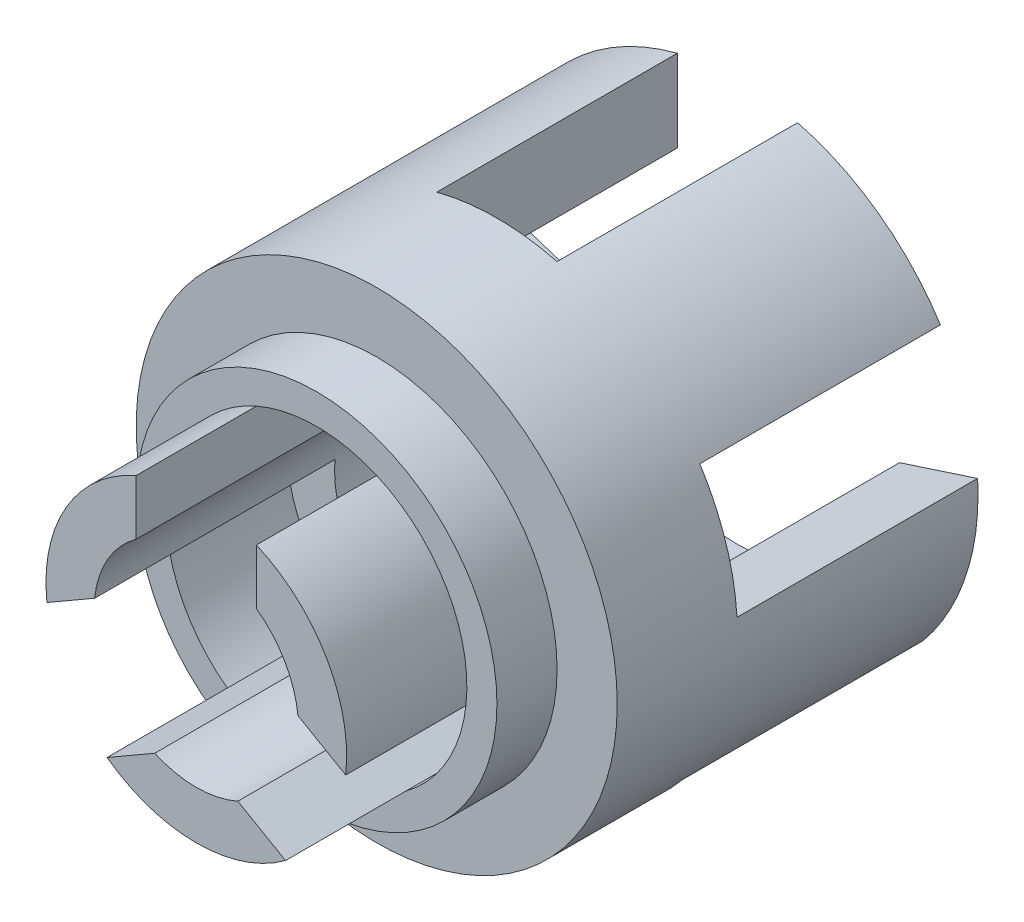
ISO-10303-21;
HEADER;
FILE_DESCRIPTION(('STEP AP214'),'2;1');
FILE_NAME('part.step','',(''),(''),'','','');
FILE_SCHEMA(('AUTOMOTIVE_DESIGN { 1 0 10303 214 1 1 1 1 }'));
ENDSEC;
DATA;
#1=APPLICATION_CONTEXT('core data for automotive mechanical design processes');
#2=APPLICATION_PROTOCOL_DEFINITION('international standard','automotive_design',2000,#1);
#3=PRODUCT_CONTEXT('',#1,'mechanical');
#4=PRODUCT('Part','Part','',(#3));
#5=PRODUCT_RELATED_PRODUCT_CATEGORY('part','',(#4));
#6=PRODUCT_DEFINITION_FORMATION('','',#4);
#7=PRODUCT_DEFINITION_CONTEXT('part definition',#1,'design');
#8=PRODUCT_DEFINITION('design','',#6,#7);
#9=PRODUCT_DEFINITION_SHAPE('','',#8);
#10=(LENGTH_UNIT() NAMED_UNIT(*) SI_UNIT(.MILLI.,.METRE.));
#11=(NAMED_UNIT(*) PLANE_ANGLE_UNIT() SI_UNIT($,.RADIAN.));
#12=(NAMED_UNIT(*) SI_UNIT($,.STERADIAN.) SOLID_ANGLE_UNIT());
#13=UNCERTAINTY_MEASURE_WITH_UNIT(LENGTH_MEASURE(1.E-05),#10,'distance_accuracy_value','');
#14=(GEOMETRIC_REPRESENTATION_CONTEXT(3) GLOBAL_UNCERTAINTY_ASSIGNED_CONTEXT((#13)) GLOBAL_UNIT_ASSIGNED_CONTEXT((#10,
#11,#12)) REPRESENTATION_CONTEXT('',''));
#15=CARTESIAN_POINT('',(0.,0.,0.));
#16=DIRECTION('',(0.,0.,1.));
#17=DIRECTION('',(1.,0.,0.));
#18=AXIS2_PLACEMENT_3D('',#15,#16,#17);
#19=CARTESIAN_POINT('',(0.,0.,1.27));
#20=DIRECTION('',(0.,0.,1.));
#21=DIRECTION('',(1.,0.,0.));
#22=AXIS2_PLACEMENT_3D('',#19,#20,#21);
#23=PLANE('',#22);
#24=CARTESIAN_POINT('',(0.,0.,1.27));
#25=DIRECTION('',(0.,0.,1.));
#26=DIRECTION('',(1.,0.,0.));
#27=AXIS2_PLACEMENT_3D('',#24,#25,#26);
#28=CIRCLE('',#27,3.81);
#29=CARTESIAN_POINT('',(3.81,0.,1.27));
#30=VERTEX_POINT('',#29);
#31=EDGE_CURVE('E498',#30,#30,#28,.T.);
#32=ORIENTED_EDGE('',*,*,#31,.T.);
#33=EDGE_LOOP('',(#32));
#34=FACE_BOUND('',#33,.T.);
#35=CARTESIAN_POINT('',(0.,0.,1.27));
#36=DIRECTION('',(0.,0.,1.));
#37=DIRECTION('',(1.,0.,0.));
#38=AXIS2_PLACEMENT_3D('',#35,#36,#37);
#39=CIRCLE('',#38,3.175);
#40=CARTESIAN_POINT('',(1.88507812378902,-2.55482004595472,1.27));
#41=VERTEX_POINT('',#40);
#42=CARTESIAN_POINT('',(3.15507812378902,-0.355115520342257,1.27));
#43=VERTEX_POINT('',#42);
#44=EDGE_CURVE('E501',#41,#43,#39,.T.);
#45=ORIENTED_EDGE('',*,*,#44,.F.);
#46=CARTESIAN_POINT('',(0.,0.,1.27));
#47=DIRECTION('',(0.,0.,1.));
#48=DIRECTION('',(1.,0.,0.));
#49=AXIS2_PLACEMENT_3D('',#46,#47,#48);
#50=CIRCLE('',#49,3.175);
#51=CARTESIAN_POINT('',(-1.88507812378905,-2.5548200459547,1.27));
#52=VERTEX_POINT('',#51);
#53=EDGE_CURVE('E303',#52,#41,#50,.T.);
#54=ORIENTED_EDGE('',*,*,#53,.F.);
#55=CARTESIAN_POINT('',(0.,0.,1.27));
#56=DIRECTION('',(0.,0.,1.));
#57=DIRECTION('',(1.,0.,0.));
#58=AXIS2_PLACEMENT_3D('',#55,#56,#57);
#59=CIRCLE('',#58,3.175);
#60=CARTESIAN_POINT('',(-3.15507812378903,-0.355115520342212,1.27));
#61=VERTEX_POINT('',#60);
#62=EDGE_CURVE('E504',#61,#52,#59,.T.);
#63=ORIENTED_EDGE('',*,*,#62,.F.);
#64=CARTESIAN_POINT('',(0.,0.,1.27));
#65=DIRECTION('',(0.,0.,1.));
#66=DIRECTION('',(1.,0.,0.));
#67=AXIS2_PLACEMENT_3D('',#64,#65,#66);
#68=CIRCLE('',#67,3.175);
#69=CARTESIAN_POINT('',(-1.27,2.90993556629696,1.27));
#70=VERTEX_POINT('',#69);
#71=EDGE_CURVE('E355',#70,#61,#68,.T.);
#72=ORIENTED_EDGE('',*,*,#71,.F.);
#73=CARTESIAN_POINT('',(0.,0.,1.27));
#74=DIRECTION('',(0.,0.,1.));
#75=DIRECTION('',(1.,0.,0.));
#76=AXIS2_PLACEMENT_3D('',#73,#74,#75);
#77=CIRCLE('',#76,3.175);
#78=CARTESIAN_POINT('',(1.27,2.90993556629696,1.27));
#79=VERTEX_POINT('',#78);
#80=EDGE_CURVE('E507',#79,#70,#77,.T.);
#81=ORIENTED_EDGE('',*,*,#80,.F.);
#82=CARTESIAN_POINT('',(0.,0.,1.27));
#83=DIRECTION('',(0.,0.,1.));
#84=DIRECTION('',(1.,0.,0.));
#85=AXIS2_PLACEMENT_3D('',#82,#83,#84);
#86=CIRCLE('',#85,3.175);
#87=EDGE_CURVE('E340',#43,#79,#86,.T.);
#88=ORIENTED_EDGE('',*,*,#87,.F.);
#89=EDGE_LOOP('',(#45,#54,#63,#72,#81,#88));
#90=FACE_BOUND('',#89,.T.);
#91=ADVANCED_FACE('F36',(#34,#90),#23,.T.);
#92=CARTESIAN_POINT('',(0.,0.,-7.62));
#93=DIRECTION('',(0.,0.,1.));
#94=DIRECTION('',(1.,0.,0.));
#95=AXIS2_PLACEMENT_3D('',#92,#93,#94);
#96=CYLINDRICAL_SURFACE('',#95,5.08);
#97=DIRECTION('',(0.,0.,-1.));
#98=VECTOR('',#97,1.);
#99=CARTESIAN_POINT('',(1.27,4.91868884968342,-2.54));
#100=LINE('',#99,#98);
#101=CARTESIAN_POINT('',(1.27,4.91868884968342,-2.54));
#102=VERTEX_POINT('',#101);
#103=CARTESIAN_POINT('',(1.27,4.91868884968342,-7.62));
#104=VERTEX_POINT('',#103);
#105=EDGE_CURVE('E392',#102,#104,#100,.T.);
#106=ORIENTED_EDGE('',*,*,#105,.F.);
#107=CARTESIAN_POINT('',(0.,0.,-2.54));
#108=DIRECTION('',(0.,0.,-1.));
#109=DIRECTION('',(-1.,0.,0.));
#110=AXIS2_PLACEMENT_3D('',#107,#108,#109);
#111=CIRCLE('',#110,5.08);
#112=CARTESIAN_POINT('',(-1.27,4.91868884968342,-2.54));
#113=VERTEX_POINT('',#112);
#114=EDGE_CURVE('E377',#113,#102,#111,.T.);
#115=ORIENTED_EDGE('',*,*,#114,.F.);
#116=DIRECTION('',(0.,0.,-1.));
#117=VECTOR('',#116,1.);
#118=CARTESIAN_POINT('',(-1.27,4.91868884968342,-2.54));
#119=LINE('',#118,#117);
#120=CARTESIAN_POINT('',(-1.27,4.91868884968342,-7.62));
#121=VERTEX_POINT('',#120);
#122=EDGE_CURVE('E394',#113,#121,#119,.T.);
#123=ORIENTED_EDGE('',*,*,#122,.T.);
#124=CARTESIAN_POINT('',(0.,0.,-7.62));
#125=DIRECTION('',(0.,0.,1.));
#126=DIRECTION('',(1.,0.,0.));
#127=AXIS2_PLACEMENT_3D('',#124,#125,#126);
#128=CIRCLE('',#127,5.08);
#129=CARTESIAN_POINT('',(-4.2854994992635,2.72780022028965,-7.62));
#130=VERTEX_POINT('',#129);
#131=EDGE_CURVE('E45',#121,#130,#128,.T.);
#132=ORIENTED_EDGE('',*,*,#131,.T.);
#133=DIRECTION('',(0.,0.,-1.));
#134=VECTOR('',#133,1.);
#135=CARTESIAN_POINT('',(-4.2854994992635,2.72780022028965,-2.54));
#136=LINE('',#135,#134);
#137=CARTESIAN_POINT('',(-4.2854994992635,2.72780022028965,-2.54));
#138=VERTEX_POINT('',#137);
#139=EDGE_CURVE('E476',#138,#130,#136,.T.);
#140=ORIENTED_EDGE('',*,*,#139,.F.);
#141=CARTESIAN_POINT('',(0.,0.,-2.54));
#142=DIRECTION('',(0.,0.,-1.));
#143=DIRECTION('',(-1.,0.,0.));
#144=AXIS2_PLACEMENT_3D('',#141,#142,#143);
#145=CIRCLE('',#144,5.08);
#146=CARTESIAN_POINT('',(-5.07040266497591,0.312116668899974,-2.54));
#147=VERTEX_POINT('',#146);
#148=EDGE_CURVE('E462',#147,#138,#145,.T.);
#149=ORIENTED_EDGE('',*,*,#148,.F.);
#150=DIRECTION('',(0.,0.,-1.));
#151=VECTOR('',#150,1.);
#152=CARTESIAN_POINT('',(-5.07040266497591,0.312116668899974,-2.54));
#153=LINE('',#152,#151);
#154=CARTESIAN_POINT('',(-5.07040266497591,0.312116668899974,-7.62));
#155=VERTEX_POINT('',#154);
#156=EDGE_CURVE('E468',#147,#155,#153,.T.);
#157=ORIENTED_EDGE('',*,*,#156,.T.);
#158=CARTESIAN_POINT('',(-3.91858434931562,-3.23281559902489,-7.62));
#159=VERTEX_POINT('',#158);
#160=EDGE_CURVE('E577',#155,#159,#128,.T.);
#161=ORIENTED_EDGE('',*,*,#160,.T.);
#162=DIRECTION('',(0.,0.,-1.));
#163=VECTOR('',#162,1.);
#164=CARTESIAN_POINT('',(-3.91858434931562,-3.23281559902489,-2.54));
#165=LINE('',#164,#163);
#166=CARTESIAN_POINT('',(-3.91858434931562,-3.23281559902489,-2.54));
#167=VERTEX_POINT('',#166);
#168=EDGE_CURVE('E456',#167,#159,#165,.T.);
#169=ORIENTED_EDGE('',*,*,#168,.F.);
#170=CARTESIAN_POINT('',(0.,0.,-2.54));
#171=DIRECTION('',(0.,0.,-1.));
#172=DIRECTION('',(-1.,0.,0.));
#173=AXIS2_PLACEMENT_3D('',#170,#171,#172);
#174=CIRCLE('',#173,5.08);
#175=CARTESIAN_POINT('',(-1.86368118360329,-4.72579013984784,-2.54));
#176=VERTEX_POINT('',#175);
#177=EDGE_CURVE('E442',#176,#167,#174,.T.);
#178=ORIENTED_EDGE('',*,*,#177,.F.);
#179=DIRECTION('',(0.,0.,-1.));
#180=VECTOR('',#179,1.);
#181=CARTESIAN_POINT('',(-1.86368118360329,-4.72579013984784,-2.54));
#182=LINE('',#181,#180);
#183=CARTESIAN_POINT('',(-1.86368118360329,-4.72579013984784,-7.62));
#184=VERTEX_POINT('',#183);
#185=EDGE_CURVE('E446',#176,#184,#182,.T.);
#186=ORIENTED_EDGE('',*,*,#185,.T.);
#187=CARTESIAN_POINT('',(1.86368118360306,-4.72579013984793,-7.62));
#188=VERTEX_POINT('',#187);
#189=EDGE_CURVE('E524',#184,#188,#128,.T.);
#190=ORIENTED_EDGE('',*,*,#189,.T.);
#191=DIRECTION('',(0.,0.,-1.));
#192=VECTOR('',#191,1.);
#193=CARTESIAN_POINT('',(1.86368118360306,-4.72579013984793,-2.54));
#194=LINE('',#193,#192);
#195=CARTESIAN_POINT('',(1.86368118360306,-4.72579013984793,-2.54));
#196=VERTEX_POINT('',#195);
#197=EDGE_CURVE('E436',#196,#188,#194,.T.);
#198=ORIENTED_EDGE('',*,*,#197,.F.);
#199=CARTESIAN_POINT('',(0.,0.,-2.54));
#200=DIRECTION('',(0.,0.,-1.));
#201=DIRECTION('',(-1.,0.,0.));
#202=AXIS2_PLACEMENT_3D('',#199,#200,#201);
#203=CIRCLE('',#202,5.08);
#204=CARTESIAN_POINT('',(3.91858434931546,-3.23281559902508,-2.54));
#205=VERTEX_POINT('',#204);
#206=EDGE_CURVE('E422',#205,#196,#203,.T.);
#207=ORIENTED_EDGE('',*,*,#206,.F.);
#208=DIRECTION('',(0.,0.,-1.));
#209=VECTOR('',#208,1.);
#210=CARTESIAN_POINT('',(3.91858434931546,-3.23281559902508,-2.54));
#211=LINE('',#210,#209);
#212=CARTESIAN_POINT('',(3.91858434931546,-3.23281559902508,-7.62));
#213=VERTEX_POINT('',#212);
#214=EDGE_CURVE('E426',#205,#213,#211,.T.);
#215=ORIENTED_EDGE('',*,*,#214,.T.);
#216=CARTESIAN_POINT('',(5.07040266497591,0.31211666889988,-7.62));
#217=VERTEX_POINT('',#216);
#218=EDGE_CURVE('E47',#213,#217,#128,.T.);
#219=ORIENTED_EDGE('',*,*,#218,.T.);
#220=DIRECTION('',(0.,0.,-1.));
#221=VECTOR('',#220,1.);
#222=CARTESIAN_POINT('',(5.07040266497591,0.31211666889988,-2.54));
#223=LINE('',#222,#221);
#224=CARTESIAN_POINT('',(5.07040266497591,0.31211666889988,-2.54));
#225=VERTEX_POINT('',#224);
#226=EDGE_CURVE('E416',#225,#217,#223,.T.);
#227=ORIENTED_EDGE('',*,*,#226,.F.);
#228=CARTESIAN_POINT('',(0.,0.,-2.54));
#229=DIRECTION('',(0.,0.,-1.));
#230=DIRECTION('',(-1.,0.,0.));
#231=AXIS2_PLACEMENT_3D('',#228,#229,#230);
#232=CIRCLE('',#231,5.08);
#233=CARTESIAN_POINT('',(4.28549949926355,2.72780022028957,-2.54));
#234=VERTEX_POINT('',#233);
#235=EDGE_CURVE('E400',#234,#225,#232,.T.);
#236=ORIENTED_EDGE('',*,*,#235,.F.);
#237=DIRECTION('',(0.,0.,-1.));
#238=VECTOR('',#237,1.);
#239=CARTESIAN_POINT('',(4.28549949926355,2.72780022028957,-2.54));
#240=LINE('',#239,#238);
#241=CARTESIAN_POINT('',(4.28549949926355,2.72780022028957,-7.62));
#242=VERTEX_POINT('',#241);
#243=EDGE_CURVE('E406',#234,#242,#240,.T.);
#244=ORIENTED_EDGE('',*,*,#243,.T.);
#245=EDGE_CURVE('E12',#242,#104,#128,.T.);
#246=ORIENTED_EDGE('',*,*,#245,.T.);
#247=EDGE_LOOP('',(#106,#115,#123,#132,#140,#149,#157,#161,#169,#178,#186,#190,#198,#207,#215,
#219,#227,#236,#244,#246));
#248=FACE_BOUND('',#247,.T.);
#249=CARTESIAN_POINT('',(0.,0.,0.));
#250=DIRECTION('',(0.,0.,1.));
#251=DIRECTION('',(1.,0.,0.));
#252=AXIS2_PLACEMENT_3D('',#249,#250,#251);
#253=CIRCLE('',#252,5.08);
#254=CARTESIAN_POINT('',(5.08,0.,0.));
#255=VERTEX_POINT('',#254);
#256=EDGE_CURVE('E522',#255,#255,#253,.T.);
#257=ORIENTED_EDGE('',*,*,#256,.F.);
#258=EDGE_LOOP('',(#257));
#259=FACE_BOUND('',#258,.T.);
#260=ADVANCED_FACE('F38',(#248,#259),#96,.T.);
#261=CARTESIAN_POINT('',(0.,0.,-7.62));
#262=DIRECTION('',(0.,0.,1.));
#263=DIRECTION('',(1.,0.,0.));
#264=AXIS2_PLACEMENT_3D('',#261,#262,#263);
#265=PLANE('',#264);
#266=DIRECTION('',(0.,-1.,0.));
#267=VECTOR('',#266,1.);
#268=CARTESIAN_POINT('',(-1.27,0.,-7.62));
#269=LINE('',#268,#267);
#270=CARTESIAN_POINT('',(-1.27,3.18514379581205,-7.62));
#271=VERTEX_POINT('',#270);
#272=EDGE_CURVE('E383',#121,#271,#269,.T.);
#273=ORIENTED_EDGE('',*,*,#272,.T.);
#274=CARTESIAN_POINT('',(0.,0.,-7.62));
#275=DIRECTION('',(0.,0.,-1.));
#276=DIRECTION('',(-1.,0.,0.));
#277=AXIS2_PLACEMENT_3D('',#274,#275,#276);
#278=CIRCLE('',#277,3.429);
#279=CARTESIAN_POINT('',(-2.63680017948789,2.19210533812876,-7.62));
#280=VERTEX_POINT('',#279);
#281=EDGE_CURVE('E485',#280,#271,#278,.T.);
#282=ORIENTED_EDGE('',*,*,#281,.F.);
#283=DIRECTION('',(0.951056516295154,-0.309016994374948,0.));
#284=VECTOR('',#283,1.);
#285=CARTESIAN_POINT('',(0.392451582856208,1.20784177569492,-7.62));
#286=LINE('',#285,#284);
#287=EDGE_CURVE('E463',#130,#280,#286,.T.);
#288=ORIENTED_EDGE('',*,*,#287,.F.);
#289=ORIENTED_EDGE('',*,*,#131,.F.);
#290=EDGE_LOOP('',(#273,#282,#288,#289));
#291=FACE_BOUND('',#290,.T.);
#292=ADVANCED_FACE('F532',(#291),#265,.F.);
#293=CARTESIAN_POINT('',(1.27,3.18514379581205,-7.62));
#294=VERTEX_POINT('',#293);
#295=CARTESIAN_POINT('',(2.63680017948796,2.19210533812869,-7.62));
#296=VERTEX_POINT('',#295);
#297=EDGE_CURVE('E488',#294,#296,#278,.T.);
#298=ORIENTED_EDGE('',*,*,#297,.F.);
#299=DIRECTION('',(0.,-1.,0.));
#300=VECTOR('',#299,1.);
#301=CARTESIAN_POINT('',(1.27,0.,-7.62));
#302=LINE('',#301,#300);
#303=EDGE_CURVE('E378',#104,#294,#302,.T.);
#304=ORIENTED_EDGE('',*,*,#303,.F.);
#305=ORIENTED_EDGE('',*,*,#245,.F.);
#306=DIRECTION('',(-0.951056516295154,-0.309016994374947,0.));
#307=VECTOR('',#306,1.);
#308=CARTESIAN_POINT('',(-0.39245158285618,1.20784177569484,-7.62));
#309=LINE('',#308,#307);
#310=EDGE_CURVE('E407',#242,#296,#309,.T.);
#311=ORIENTED_EDGE('',*,*,#310,.T.);
#312=EDGE_LOOP('',(#298,#304,#305,#311));
#313=FACE_BOUND('',#312,.T.);
#314=ADVANCED_FACE('F538',(#313),#265,.F.);
#315=CARTESIAN_POINT('',(3.42170334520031,-0.223578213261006,-7.62));
#316=VERTEX_POINT('',#315);
#317=CARTESIAN_POINT('',(2.89963213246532,-1.83034818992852,-7.62));
#318=VERTEX_POINT('',#317);
#319=EDGE_CURVE('E557',#316,#318,#278,.T.);
#320=ORIENTED_EDGE('',*,*,#319,.F.);
#321=DIRECTION('',(-0.951056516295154,-0.309016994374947,0.));
#322=VECTOR('',#321,1.);
#323=CARTESIAN_POINT('',(0.392451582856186,-1.20784177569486,-7.62));
#324=LINE('',#323,#322);
#325=EDGE_CURVE('E401',#217,#316,#324,.T.);
#326=ORIENTED_EDGE('',*,*,#325,.F.);
#327=ORIENTED_EDGE('',*,*,#218,.F.);
#328=DIRECTION('',(-0.587785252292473,0.809016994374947,0.));
#329=VECTOR('',#328,1.);
#330=CARTESIAN_POINT('',(1.0274515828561,0.746487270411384,-7.62));
#331=LINE('',#330,#329);
#332=EDGE_CURVE('E427',#213,#318,#331,.T.);
#333=ORIENTED_EDGE('',*,*,#332,.T.);
#334=EDGE_LOOP('',(#320,#326,#327,#333));
#335=FACE_BOUND('',#334,.T.);
#336=ADVANCED_FACE('F612',(#335),#265,.F.);
#337=CARTESIAN_POINT('',(0.844728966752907,-3.32332273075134,-7.62));
#338=VERTEX_POINT('',#337);
#339=CARTESIAN_POINT('',(-0.844728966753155,-3.32332273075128,-7.62));
#340=VERTEX_POINT('',#339);
#341=EDGE_CURVE('E559',#338,#340,#278,.T.);
#342=ORIENTED_EDGE('',*,*,#341,.F.);
#343=DIRECTION('',(-0.587785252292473,0.809016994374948,0.));
#344=VECTOR('',#343,1.);
#345=CARTESIAN_POINT('',(-1.02745158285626,-0.746487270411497,-7.62));
#346=LINE('',#345,#344);
#347=EDGE_CURVE('E423',#188,#338,#346,.T.);
#348=ORIENTED_EDGE('',*,*,#347,.F.);
#349=ORIENTED_EDGE('',*,*,#189,.F.);
#350=DIRECTION('',(0.587785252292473,0.809016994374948,0.));
#351=VECTOR('',#350,1.);
#352=CARTESIAN_POINT('',(1.02745158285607,-0.746487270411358,-7.62));
#353=LINE('',#352,#351);
#354=EDGE_CURVE('E447',#184,#340,#353,.T.);
#355=ORIENTED_EDGE('',*,*,#354,.T.);
#356=EDGE_LOOP('',(#342,#348,#349,#355));
#357=FACE_BOUND('',#356,.T.);
#358=ADVANCED_FACE('F621',(#357),#265,.F.);
#359=CARTESIAN_POINT('',(-2.89963213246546,-1.83034818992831,-7.62));
#360=VERTEX_POINT('',#359);
#361=CARTESIAN_POINT('',(-3.42170334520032,-0.223578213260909,-7.62));
#362=VERTEX_POINT('',#361);
#363=EDGE_CURVE('E391',#360,#362,#278,.T.);
#364=ORIENTED_EDGE('',*,*,#363,.F.);
#365=DIRECTION('',(0.587785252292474,0.809016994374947,0.));
#366=VECTOR('',#365,1.);
#367=CARTESIAN_POINT('',(-1.02745158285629,0.746487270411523,-7.62));
#368=LINE('',#367,#366);
#369=EDGE_CURVE('E443',#159,#360,#368,.T.);
#370=ORIENTED_EDGE('',*,*,#369,.F.);
#371=ORIENTED_EDGE('',*,*,#160,.F.);
#372=DIRECTION('',(0.951056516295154,-0.309016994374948,0.));
#373=VECTOR('',#372,1.);
#374=CARTESIAN_POINT('',(-0.39245158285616,-1.20784177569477,-7.62));
#375=LINE('',#374,#373);
#376=EDGE_CURVE('E374',#155,#362,#375,.T.);
#377=ORIENTED_EDGE('',*,*,#376,.T.);
#378=EDGE_LOOP('',(#364,#370,#371,#377));
#379=FACE_BOUND('',#378,.T.);
#380=ADVANCED_FACE('F541',(#379),#265,.F.);
#381=CARTESIAN_POINT('',(0.,0.,-2.54));
#382=DIRECTION('',(0.,0.,-1.));
#383=DIRECTION('',(-1.,0.,0.));
#384=AXIS2_PLACEMENT_3D('',#381,#382,#383);
#385=CYLINDRICAL_SURFACE('',#384,3.429);
#386=DIRECTION('',(0.,0.,-1.));
#387=VECTOR('',#386,1.);
#388=CARTESIAN_POINT('',(-1.27,3.18514379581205,-2.54));
#389=LINE('',#388,#387);
#390=CARTESIAN_POINT('',(-1.27,3.18514379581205,-2.54));
#391=VERTEX_POINT('',#390);
#392=EDGE_CURVE('E382',#391,#271,#389,.T.);
#393=ORIENTED_EDGE('',*,*,#392,.F.);
#394=CARTESIAN_POINT('',(0.,0.,-2.54));
#395=DIRECTION('',(0.,0.,-1.));
#396=DIRECTION('',(-1.,0.,0.));
#397=AXIS2_PLACEMENT_3D('',#394,#395,#396);
#398=CIRCLE('',#397,3.429);
#399=CARTESIAN_POINT('',(-2.63680017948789,2.19210533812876,-2.54));
#400=VERTEX_POINT('',#399);
#401=EDGE_CURVE('E480',#400,#391,#398,.T.);
#402=ORIENTED_EDGE('',*,*,#401,.F.);
#403=DIRECTION('',(0.,0.,-1.));
#404=VECTOR('',#403,1.);
#405=CARTESIAN_POINT('',(-2.63680017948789,2.19210533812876,-2.54));
#406=LINE('',#405,#404);
#407=EDGE_CURVE('E473',#400,#280,#406,.T.);
#408=ORIENTED_EDGE('',*,*,#407,.T.);
#409=ORIENTED_EDGE('',*,*,#281,.T.);
#410=EDGE_LOOP('',(#393,#402,#408,#409));
#411=FACE_BOUND('',#410,.T.);
#412=ADVANCED_FACE('F632',(#411),#385,.F.);
#413=CARTESIAN_POINT('',(1.27,3.18514379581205,-2.54));
#414=VERTEX_POINT('',#413);
#415=CARTESIAN_POINT('',(2.63680017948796,2.19210533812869,-2.54));
#416=VERTEX_POINT('',#415);
#417=EDGE_CURVE('E483',#414,#416,#398,.T.);
#418=ORIENTED_EDGE('',*,*,#417,.F.);
#419=DIRECTION('',(0.,0.,-1.));
#420=VECTOR('',#419,1.);
#421=CARTESIAN_POINT('',(1.27,3.18514379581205,-2.54));
#422=LINE('',#421,#420);
#423=EDGE_CURVE('E388',#414,#294,#422,.T.);
#424=ORIENTED_EDGE('',*,*,#423,.T.);
#425=ORIENTED_EDGE('',*,*,#297,.T.);
#426=DIRECTION('',(0.,0.,-1.));
#427=VECTOR('',#426,1.);
#428=CARTESIAN_POINT('',(2.63680017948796,2.19210533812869,-2.54));
#429=LINE('',#428,#427);
#430=EDGE_CURVE('E386',#416,#296,#429,.T.);
#431=ORIENTED_EDGE('',*,*,#430,.F.);
#432=EDGE_LOOP('',(#418,#424,#425,#431));
#433=FACE_BOUND('',#432,.T.);
#434=ADVANCED_FACE('F599',(#433),#385,.F.);
#435=CARTESIAN_POINT('',(3.42170334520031,-0.223578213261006,-2.54));
#436=VERTEX_POINT('',#435);
#437=CARTESIAN_POINT('',(2.89963213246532,-1.83034818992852,-2.54));
#438=VERTEX_POINT('',#437);
#439=EDGE_CURVE('E589',#436,#438,#398,.T.);
#440=ORIENTED_EDGE('',*,*,#439,.F.);
#441=DIRECTION('',(0.,0.,-1.));
#442=VECTOR('',#441,1.);
#443=CARTESIAN_POINT('',(3.42170334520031,-0.223578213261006,-2.54));
#444=LINE('',#443,#442);
#445=EDGE_CURVE('E413',#436,#316,#444,.T.);
#446=ORIENTED_EDGE('',*,*,#445,.T.);
#447=ORIENTED_EDGE('',*,*,#319,.T.);
#448=DIRECTION('',(0.,0.,-1.));
#449=VECTOR('',#448,1.);
#450=CARTESIAN_POINT('',(2.89963213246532,-1.83034818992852,-2.54));
#451=LINE('',#450,#449);
#452=EDGE_CURVE('E410',#438,#318,#451,.T.);
#453=ORIENTED_EDGE('',*,*,#452,.F.);
#454=EDGE_LOOP('',(#440,#446,#447,#453));
#455=FACE_BOUND('',#454,.T.);
#456=ADVANCED_FACE('F607',(#455),#385,.F.);
#457=CARTESIAN_POINT('',(0.844728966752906,-3.32332273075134,-2.54));
#458=VERTEX_POINT('',#457);
#459=CARTESIAN_POINT('',(-0.844728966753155,-3.32332273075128,-2.54));
#460=VERTEX_POINT('',#459);
#461=EDGE_CURVE('E588',#458,#460,#398,.T.);
#462=ORIENTED_EDGE('',*,*,#461,.F.);
#463=DIRECTION('',(0.,0.,-1.));
#464=VECTOR('',#463,1.);
#465=CARTESIAN_POINT('',(0.844728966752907,-3.32332273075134,-2.54));
#466=LINE('',#465,#464);
#467=EDGE_CURVE('E433',#458,#338,#466,.T.);
#468=ORIENTED_EDGE('',*,*,#467,.T.);
#469=ORIENTED_EDGE('',*,*,#341,.T.);
#470=DIRECTION('',(0.,0.,-1.));
#471=VECTOR('',#470,1.);
#472=CARTESIAN_POINT('',(-0.844728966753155,-3.32332273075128,-2.54));
#473=LINE('',#472,#471);
#474=EDGE_CURVE('E430',#460,#340,#473,.T.);
#475=ORIENTED_EDGE('',*,*,#474,.F.);
#476=EDGE_LOOP('',(#462,#468,#469,#475));
#477=FACE_BOUND('',#476,.T.);
#478=ADVANCED_FACE('F625',(#477),#385,.F.);
#479=CARTESIAN_POINT('',(-2.89963213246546,-1.83034818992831,-2.54));
#480=VERTEX_POINT('',#479);
#481=CARTESIAN_POINT('',(-3.42170334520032,-0.223578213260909,-2.54));
#482=VERTEX_POINT('',#481);
#483=EDGE_CURVE('E484',#480,#482,#398,.T.);
#484=ORIENTED_EDGE('',*,*,#483,.F.);
#485=DIRECTION('',(0.,0.,-1.));
#486=VECTOR('',#485,1.);
#487=CARTESIAN_POINT('',(-2.89963213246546,-1.83034818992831,-2.54));
#488=LINE('',#487,#486);
#489=EDGE_CURVE('E453',#480,#360,#488,.T.);
#490=ORIENTED_EDGE('',*,*,#489,.T.);
#491=ORIENTED_EDGE('',*,*,#363,.T.);
#492=DIRECTION('',(0.,0.,-1.));
#493=VECTOR('',#492,1.);
#494=CARTESIAN_POINT('',(-3.42170334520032,-0.223578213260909,-2.54));
#495=LINE('',#494,#493);
#496=EDGE_CURVE('E450',#482,#362,#495,.T.);
#497=ORIENTED_EDGE('',*,*,#496,.F.);
#498=EDGE_LOOP('',(#484,#490,#491,#497));
#499=FACE_BOUND('',#498,.T.);
#500=ADVANCED_FACE('F572',(#499),#385,.F.);
#501=CARTESIAN_POINT('',(0.,0.,1.27));
#502=DIRECTION('',(0.,0.,-1.));
#503=DIRECTION('',(-1.,0.,0.));
#504=AXIS2_PLACEMENT_3D('',#501,#502,#503);
#505=CYLINDRICAL_SURFACE('',#504,2.159);
#506=CARTESIAN_POINT('',(0.,0.,-1.27));
#507=DIRECTION('',(0.,0.,-1.));
#508=DIRECTION('',(1.,0.,0.));
#509=AXIS2_PLACEMENT_3D('',#506,#507,#508);
#510=CIRCLE('',#509,2.159);
#511=CARTESIAN_POINT('',(-1.27,1.74596133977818,-1.27));
#512=VERTEX_POINT('',#511);
#513=CARTESIAN_POINT('',(1.27,1.74596133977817,-1.27));
#514=VERTEX_POINT('',#513);
#515=EDGE_CURVE('E272',#512,#514,#510,.T.);
#516=ORIENTED_EDGE('',*,*,#515,.F.);
#517=DIRECTION('',(0.,0.,-1.));
#518=VECTOR('',#517,1.);
#519=CARTESIAN_POINT('',(-1.27,1.74596133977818,1.27));
#520=LINE('',#519,#518);
#521=CARTESIAN_POINT('',(-1.27,1.74596133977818,3.81));
#522=VERTEX_POINT('',#521);
#523=EDGE_CURVE('E278',#512,#522,#520,.F.);
#524=ORIENTED_EDGE('',*,*,#523,.T.);
#525=CARTESIAN_POINT('',(0.,0.,3.81));
#526=DIRECTION('',(0.,0.,-1.));
#527=DIRECTION('',(1.,0.,0.));
#528=AXIS2_PLACEMENT_3D('',#525,#526,#527);
#529=CIRCLE('',#528,2.159);
#530=CARTESIAN_POINT('',(-2.14704687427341,0.22687159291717,3.81));
#531=VERTEX_POINT('',#530);
#532=EDGE_CURVE('E356',#531,#522,#529,.T.);
#533=ORIENTED_EDGE('',*,*,#532,.F.);
#534=DIRECTION('',(0.,0.,-1.));
#535=VECTOR('',#534,1.);
#536=CARTESIAN_POINT('',(-2.14704687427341,0.22687159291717,1.27));
#537=LINE('',#536,#535);
#538=CARTESIAN_POINT('',(-2.14704687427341,0.22687159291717,-1.27));
#539=VERTEX_POINT('',#538);
#540=EDGE_CURVE('E493',#539,#531,#537,.F.);
#541=ORIENTED_EDGE('',*,*,#540,.F.);
#542=CARTESIAN_POINT('',(0.,0.,-1.27));
#543=DIRECTION('',(0.,0.,-1.));
#544=DIRECTION('',(1.,0.,0.));
#545=AXIS2_PLACEMENT_3D('',#542,#543,#544);
#546=CIRCLE('',#545,2.159);
#547=CARTESIAN_POINT('',(-0.877046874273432,-1.97283293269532,-1.27));
#548=VERTEX_POINT('',#547);
#549=EDGE_CURVE('E313',#548,#539,#546,.T.);
#550=ORIENTED_EDGE('',*,*,#549,.F.);
#551=DIRECTION('',(0.,0.,-1.));
#552=VECTOR('',#551,1.);
#553=CARTESIAN_POINT('',(-0.877046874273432,-1.97283293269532,1.27));
#554=LINE('',#553,#552);
#555=CARTESIAN_POINT('',(-0.877046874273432,-1.97283293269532,3.81));
#556=VERTEX_POINT('',#555);
#557=EDGE_CURVE('E279',#548,#556,#554,.F.);
#558=ORIENTED_EDGE('',*,*,#557,.T.);
#559=CARTESIAN_POINT('',(0.,0.,3.81));
#560=DIRECTION('',(0.,0.,-1.));
#561=DIRECTION('',(1.,0.,0.));
#562=AXIS2_PLACEMENT_3D('',#559,#560,#561);
#563=CIRCLE('',#562,2.159);
#564=CARTESIAN_POINT('',(0.877046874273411,-1.97283293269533,3.81));
#565=VERTEX_POINT('',#564);
#566=EDGE_CURVE('E324',#565,#556,#563,.T.);
#567=ORIENTED_EDGE('',*,*,#566,.F.);
#568=DIRECTION('',(0.,0.,-1.));
#569=VECTOR('',#568,1.);
#570=CARTESIAN_POINT('',(0.877046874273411,-1.97283293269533,1.27));
#571=LINE('',#570,#569);
#572=CARTESIAN_POINT('',(0.877046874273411,-1.97283293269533,-1.27));
#573=VERTEX_POINT('',#572);
#574=EDGE_CURVE('E491',#573,#565,#571,.F.);
#575=ORIENTED_EDGE('',*,*,#574,.F.);
#576=CARTESIAN_POINT('',(0.,0.,-1.27));
#577=DIRECTION('',(0.,0.,-1.));
#578=DIRECTION('',(1.,0.,0.));
#579=AXIS2_PLACEMENT_3D('',#576,#577,#578);
#580=CIRCLE('',#579,2.159);
#581=CARTESIAN_POINT('',(2.14704687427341,0.22687159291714,-1.27));
#582=VERTEX_POINT('',#581);
#583=EDGE_CURVE('E304',#582,#573,#580,.T.);
#584=ORIENTED_EDGE('',*,*,#583,.F.);
#585=DIRECTION('',(0.,0.,-1.));
#586=VECTOR('',#585,1.);
#587=CARTESIAN_POINT('',(2.14704687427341,0.22687159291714,1.27));
#588=LINE('',#587,#586);
#589=CARTESIAN_POINT('',(2.14704687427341,0.22687159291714,3.81));
#590=VERTEX_POINT('',#589);
#591=EDGE_CURVE('E489',#582,#590,#588,.F.);
#592=ORIENTED_EDGE('',*,*,#591,.T.);
#593=CARTESIAN_POINT('',(0.,0.,3.81));
#594=DIRECTION('',(0.,0.,-1.));
#595=DIRECTION('',(1.,0.,0.));
#596=AXIS2_PLACEMENT_3D('',#593,#594,#595);
#597=CIRCLE('',#596,2.159);
#598=CARTESIAN_POINT('',(1.27,1.74596133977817,3.81));
#599=VERTEX_POINT('',#598);
#600=EDGE_CURVE('E274',#599,#590,#597,.T.);
#601=ORIENTED_EDGE('',*,*,#600,.F.);
#602=DIRECTION('',(0.,0.,-1.));
#603=VECTOR('',#602,1.);
#604=CARTESIAN_POINT('',(1.27,1.74596133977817,1.27));
#605=LINE('',#604,#603);
#606=EDGE_CURVE('E267',#514,#599,#605,.F.);
#607=ORIENTED_EDGE('',*,*,#606,.F.);
#608=EDGE_LOOP('',(#516,#524,#533,#541,#550,#558,#567,#575,#584,#592,#601,#607));
#609=FACE_BOUND('',#608,.T.);
#610=CARTESIAN_POINT('',(0.,0.,-2.54));
#611=DIRECTION('',(0.,0.,-1.));
#612=DIRECTION('',(-1.,0.,0.));
#613=AXIS2_PLACEMENT_3D('',#610,#611,#612);
#614=CIRCLE('',#613,2.159);
#615=CARTESIAN_POINT('',(-2.159,0.,-2.54));
#616=VERTEX_POINT('',#615);
#617=EDGE_CURVE('E40',#616,#616,#614,.F.);
#618=ORIENTED_EDGE('',*,*,#617,.F.);
#619=EDGE_LOOP('',(#618));
#620=FACE_BOUND('',#619,.T.);
#621=ADVANCED_FACE('F269',(#609,#620),#505,.F.);
#622=CARTESIAN_POINT('',(0.,0.,0.));
#623=DIRECTION('',(0.,0.,1.));
#624=DIRECTION('',(1.,0.,0.));
#625=AXIS2_PLACEMENT_3D('',#622,#623,#624);
#626=PLANE('',#625);
#627=ORIENTED_EDGE('',*,*,#256,.T.);
#628=EDGE_LOOP('',(#627));
#629=FACE_BOUND('',#628,.T.);
#630=CARTESIAN_POINT('',(0.,0.,0.));
#631=DIRECTION('',(0.,0.,1.));
#632=DIRECTION('',(1.,0.,0.));
#633=AXIS2_PLACEMENT_3D('',#630,#631,#632);
#634=CIRCLE('',#633,3.81);
#635=CARTESIAN_POINT('',(3.81,0.,0.));
#636=VERTEX_POINT('',#635);
#637=EDGE_CURVE('E497',#636,#636,#634,.T.);
#638=ORIENTED_EDGE('',*,*,#637,.F.);
#639=EDGE_LOOP('',(#638));
#640=FACE_BOUND('',#639,.T.);
#641=ADVANCED_FACE('F528',(#629,#640),#626,.T.);
#642=CARTESIAN_POINT('',(0.,0.,1.27));
#643=DIRECTION('',(0.,0.,-1.));
#644=DIRECTION('',(-1.,0.,0.));
#645=AXIS2_PLACEMENT_3D('',#642,#643,#644);
#646=CYLINDRICAL_SURFACE('',#645,3.175);
#647=DIRECTION('',(0.,0.,-1.));
#648=VECTOR('',#647,1.);
#649=CARTESIAN_POINT('',(3.15507812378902,-0.355115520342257,1.27));
#650=LINE('',#649,#648);
#651=CARTESIAN_POINT('',(3.15507812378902,-0.355115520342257,-1.27));
#652=VERTEX_POINT('',#651);
#653=EDGE_CURVE('E510',#43,#652,#650,.T.);
#654=ORIENTED_EDGE('',*,*,#653,.T.);
#655=CARTESIAN_POINT('',(0.,0.,-1.27));
#656=DIRECTION('',(0.,0.,1.));
#657=DIRECTION('',(1.,0.,0.));
#658=AXIS2_PLACEMENT_3D('',#655,#656,#657);
#659=CIRCLE('',#658,3.175);
#660=CARTESIAN_POINT('',(1.88507812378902,-2.55482004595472,-1.27));
#661=VERTEX_POINT('',#660);
#662=EDGE_CURVE('E298',#661,#652,#659,.T.);
#663=ORIENTED_EDGE('',*,*,#662,.F.);
#664=DIRECTION('',(0.,0.,-1.));
#665=VECTOR('',#664,1.);
#666=CARTESIAN_POINT('',(1.88507812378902,-2.55482004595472,1.27));
#667=LINE('',#666,#665);
#668=EDGE_CURVE('E521',#41,#661,#667,.T.);
#669=ORIENTED_EDGE('',*,*,#668,.F.);
#670=ORIENTED_EDGE('',*,*,#44,.T.);
#671=EDGE_LOOP('',(#654,#663,#669,#670));
#672=FACE_BOUND('',#671,.T.);
#673=ADVANCED_FACE('F670',(#672),#646,.F.);
#674=CARTESIAN_POINT('',(-0.635,-1.09985226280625,1.27));
#675=DIRECTION('',(-0.499999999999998,-0.86602540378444,0.));
#676=DIRECTION('',(0.86602540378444,-0.499999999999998,0.));
#677=AXIS2_PLACEMENT_3D('',#674,#675,#676);
#678=PLANE('',#677);
#679=ORIENTED_EDGE('',*,*,#668,.T.);
#680=DIRECTION('',(0.86602540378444,-0.499999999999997,0.));
#681=VECTOR('',#680,1.);
#682=CARTESIAN_POINT('',(0.877046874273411,-1.97283293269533,-1.27));
#683=LINE('',#682,#681);
#684=EDGE_CURVE('E307',#573,#661,#683,.T.);
#685=ORIENTED_EDGE('',*,*,#684,.F.);
#686=ORIENTED_EDGE('',*,*,#574,.T.);
#687=DIRECTION('',(-0.86602540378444,0.499999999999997,0.));
#688=VECTOR('',#687,1.);
#689=CARTESIAN_POINT('',(0.877046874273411,-1.97283293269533,3.81));
#690=LINE('',#689,#688);
#691=CARTESIAN_POINT('',(1.88507812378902,-2.55482004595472,3.81));
#692=VERTEX_POINT('',#691);
#693=EDGE_CURVE('E331',#692,#565,#690,.T.);
#694=ORIENTED_EDGE('',*,*,#693,.F.);
#695=DIRECTION('',(0.,0.,-1.));
#696=VECTOR('',#695,1.);
#697=CARTESIAN_POINT('',(1.88507812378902,-2.55482004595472,3.81));
#698=LINE('',#697,#696);
#699=EDGE_CURVE('E334',#692,#41,#698,.T.);
#700=ORIENTED_EDGE('',*,*,#699,.T.);
#701=EDGE_LOOP('',(#679,#685,#686,#694,#700));
#702=FACE_BOUND('',#701,.T.);
#703=ADVANCED_FACE('F666',(#702),#678,.F.);
#704=CARTESIAN_POINT('',(0.63499999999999,-1.09985226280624,1.27));
#705=DIRECTION('',(-0.499999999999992,0.866025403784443,0.));
#706=DIRECTION('',(-0.866025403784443,-0.499999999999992,0.));
#707=AXIS2_PLACEMENT_3D('',#704,#705,#706);
#708=PLANE('',#707);
#709=ORIENTED_EDGE('',*,*,#557,.F.);
#710=DIRECTION('',(0.866025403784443,0.499999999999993,0.));
#711=VECTOR('',#710,1.);
#712=CARTESIAN_POINT('',(-0.877046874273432,-1.97283293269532,-1.27));
#713=LINE('',#712,#711);
#714=CARTESIAN_POINT('',(-1.88507812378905,-2.5548200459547,-1.27));
#715=VERTEX_POINT('',#714);
#716=EDGE_CURVE('E308',#715,#548,#713,.T.);
#717=ORIENTED_EDGE('',*,*,#716,.F.);
#718=DIRECTION('',(0.,0.,-1.));
#719=VECTOR('',#718,1.);
#720=CARTESIAN_POINT('',(-1.88507812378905,-2.5548200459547,1.27));
#721=LINE('',#720,#719);
#722=EDGE_CURVE('E519',#52,#715,#721,.T.);
#723=ORIENTED_EDGE('',*,*,#722,.F.);
#724=DIRECTION('',(0.,0.,-1.));
#725=VECTOR('',#724,1.);
#726=CARTESIAN_POINT('',(-1.88507812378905,-2.5548200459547,3.81));
#727=LINE('',#726,#725);
#728=CARTESIAN_POINT('',(-1.88507812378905,-2.5548200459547,3.81));
#729=VERTEX_POINT('',#728);
#730=EDGE_CURVE('E338',#729,#52,#727,.T.);
#731=ORIENTED_EDGE('',*,*,#730,.F.);
#732=DIRECTION('',(-0.866025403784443,-0.499999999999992,0.));
#733=VECTOR('',#732,1.);
#734=CARTESIAN_POINT('',(-0.877046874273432,-1.97283293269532,3.81));
#735=LINE('',#734,#733);
#736=EDGE_CURVE('E327',#556,#729,#735,.T.);
#737=ORIENTED_EDGE('',*,*,#736,.F.);
#738=EDGE_LOOP('',(#709,#717,#723,#731,#737));
#739=FACE_BOUND('',#738,.T.);
#740=ADVANCED_FACE('F662',(#739),#708,.T.);
#741=CARTESIAN_POINT('',(0.,0.,1.27));
#742=DIRECTION('',(0.,0.,-1.));
#743=DIRECTION('',(-1.,0.,0.));
#744=AXIS2_PLACEMENT_3D('',#741,#742,#743);
#745=CYLINDRICAL_SURFACE('',#744,3.175);
#746=ORIENTED_EDGE('',*,*,#722,.T.);
#747=CARTESIAN_POINT('',(0.,0.,-1.27));
#748=DIRECTION('',(0.,0.,1.));
#749=DIRECTION('',(1.,0.,0.));
#750=AXIS2_PLACEMENT_3D('',#747,#748,#749);
#751=CIRCLE('',#750,3.175);
#752=CARTESIAN_POINT('',(-3.15507812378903,-0.355115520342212,-1.27));
#753=VERTEX_POINT('',#752);
#754=EDGE_CURVE('E319',#753,#715,#751,.T.);
#755=ORIENTED_EDGE('',*,*,#754,.F.);
#756=DIRECTION('',(0.,0.,-1.));
#757=VECTOR('',#756,1.);
#758=CARTESIAN_POINT('',(-3.15507812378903,-0.355115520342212,1.27));
#759=LINE('',#758,#757);
#760=EDGE_CURVE('E517',#61,#753,#759,.T.);
#761=ORIENTED_EDGE('',*,*,#760,.F.);
#762=ORIENTED_EDGE('',*,*,#62,.T.);
#763=EDGE_LOOP('',(#746,#755,#761,#762));
#764=FACE_BOUND('',#763,.T.);
#765=ADVANCED_FACE('F658',(#764),#745,.F.);
#766=CARTESIAN_POINT('',(-0.63499999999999,1.09985226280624,1.27));
#767=DIRECTION('',(-0.499999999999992,0.866025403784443,0.));
#768=DIRECTION('',(-0.866025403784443,-0.499999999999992,0.));
#769=AXIS2_PLACEMENT_3D('',#766,#767,#768);
#770=PLANE('',#769);
#771=ORIENTED_EDGE('',*,*,#760,.T.);
#772=DIRECTION('',(-0.866025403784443,-0.499999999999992,0.));
#773=VECTOR('',#772,1.);
#774=CARTESIAN_POINT('',(-2.14704687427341,0.22687159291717,-1.27));
#775=LINE('',#774,#773);
#776=EDGE_CURVE('E316',#539,#753,#775,.T.);
#777=ORIENTED_EDGE('',*,*,#776,.F.);
#778=ORIENTED_EDGE('',*,*,#540,.T.);
#779=DIRECTION('',(0.866025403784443,0.499999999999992,0.));
#780=VECTOR('',#779,1.);
#781=CARTESIAN_POINT('',(-2.14704687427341,0.22687159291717,3.81));
#782=LINE('',#781,#780);
#783=CARTESIAN_POINT('',(-3.15507812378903,-0.355115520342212,3.81));
#784=VERTEX_POINT('',#783);
#785=EDGE_CURVE('E363',#784,#531,#782,.T.);
#786=ORIENTED_EDGE('',*,*,#785,.F.);
#787=DIRECTION('',(0.,0.,-1.));
#788=VECTOR('',#787,1.);
#789=CARTESIAN_POINT('',(-3.15507812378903,-0.355115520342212,3.81));
#790=LINE('',#789,#788);
#791=EDGE_CURVE('E366',#784,#61,#790,.T.);
#792=ORIENTED_EDGE('',*,*,#791,.T.);
#793=EDGE_LOOP('',(#771,#777,#778,#786,#792));
#794=FACE_BOUND('',#793,.T.);
#795=ADVANCED_FACE('F654',(#794),#770,.F.);
#796=CARTESIAN_POINT('',(-1.27,0.,1.27));
#797=DIRECTION('',(1.,0.,0.));
#798=DIRECTION('',(0.,1.,0.));
#799=AXIS2_PLACEMENT_3D('',#796,#797,#798);
#800=PLANE('',#799);
#801=ORIENTED_EDGE('',*,*,#523,.F.);
#802=DIRECTION('',(0.,-1.,0.));
#803=VECTOR('',#802,1.);
#804=CARTESIAN_POINT('',(-1.27,1.74596133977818,-1.27));
#805=LINE('',#804,#803);
#806=CARTESIAN_POINT('',(-1.27,2.90993556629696,-1.27));
#807=VERTEX_POINT('',#806);
#808=EDGE_CURVE('E294',#807,#512,#805,.T.);
#809=ORIENTED_EDGE('',*,*,#808,.F.);
#810=DIRECTION('',(0.,0.,-1.));
#811=VECTOR('',#810,1.);
#812=CARTESIAN_POINT('',(-1.27,2.90993556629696,1.27));
#813=LINE('',#812,#811);
#814=EDGE_CURVE('E515',#70,#807,#813,.T.);
#815=ORIENTED_EDGE('',*,*,#814,.F.);
#816=DIRECTION('',(0.,0.,-1.));
#817=VECTOR('',#816,1.);
#818=CARTESIAN_POINT('',(-1.27,2.90993556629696,3.81));
#819=LINE('',#818,#817);
#820=CARTESIAN_POINT('',(-1.27,2.90993556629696,3.81));
#821=VERTEX_POINT('',#820);
#822=EDGE_CURVE('E371',#821,#70,#819,.T.);
#823=ORIENTED_EDGE('',*,*,#822,.F.);
#824=DIRECTION('',(0.,1.,0.));
#825=VECTOR('',#824,1.);
#826=CARTESIAN_POINT('',(-1.27,1.74596133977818,3.81));
#827=LINE('',#826,#825);
#828=EDGE_CURVE('E359',#522,#821,#827,.T.);
#829=ORIENTED_EDGE('',*,*,#828,.F.);
#830=EDGE_LOOP('',(#801,#809,#815,#823,#829));
#831=FACE_BOUND('',#830,.T.);
#832=ADVANCED_FACE('F650',(#831),#800,.T.);
#833=CARTESIAN_POINT('',(0.,0.,1.27));
#834=DIRECTION('',(0.,0.,-1.));
#835=DIRECTION('',(-1.,0.,0.));
#836=AXIS2_PLACEMENT_3D('',#833,#834,#835);
#837=CYLINDRICAL_SURFACE('',#836,3.175);
#838=ORIENTED_EDGE('',*,*,#814,.T.);
#839=CARTESIAN_POINT('',(0.,0.,-1.27));
#840=DIRECTION('',(0.,0.,1.));
#841=DIRECTION('',(1.,0.,0.));
#842=AXIS2_PLACEMENT_3D('',#839,#840,#841);
#843=CIRCLE('',#842,3.175);
#844=CARTESIAN_POINT('',(1.27,2.90993556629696,-1.27));
#845=VERTEX_POINT('',#844);
#846=EDGE_CURVE('E289',#845,#807,#843,.T.);
#847=ORIENTED_EDGE('',*,*,#846,.F.);
#848=DIRECTION('',(0.,0.,-1.));
#849=VECTOR('',#848,1.);
#850=CARTESIAN_POINT('',(1.27,2.90993556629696,1.27));
#851=LINE('',#850,#849);
#852=EDGE_CURVE('E285',#79,#845,#851,.T.);
#853=ORIENTED_EDGE('',*,*,#852,.F.);
#854=ORIENTED_EDGE('',*,*,#80,.T.);
#855=EDGE_LOOP('',(#838,#847,#853,#854));
#856=FACE_BOUND('',#855,.T.);
#857=ADVANCED_FACE('F647',(#856),#837,.F.);
#858=CARTESIAN_POINT('',(1.27,0.,1.27));
#859=DIRECTION('',(1.,0.,0.));
#860=DIRECTION('',(0.,1.,0.));
#861=AXIS2_PLACEMENT_3D('',#858,#859,#860);
#862=PLANE('',#861);
#863=ORIENTED_EDGE('',*,*,#852,.T.);
#864=DIRECTION('',(0.,1.,0.));
#865=VECTOR('',#864,1.);
#866=CARTESIAN_POINT('',(1.27,1.74596133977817,-1.27));
#867=LINE('',#866,#865);
#868=EDGE_CURVE('E282',#514,#845,#867,.T.);
#869=ORIENTED_EDGE('',*,*,#868,.F.);
#870=ORIENTED_EDGE('',*,*,#606,.T.);
#871=DIRECTION('',(0.,-1.,0.));
#872=VECTOR('',#871,1.);
#873=CARTESIAN_POINT('',(1.27,1.74596133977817,3.81));
#874=LINE('',#873,#872);
#875=CARTESIAN_POINT('',(1.27,2.90993556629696,3.81));
#876=VERTEX_POINT('',#875);
#877=EDGE_CURVE('E346',#876,#599,#874,.T.);
#878=ORIENTED_EDGE('',*,*,#877,.F.);
#879=DIRECTION('',(0.,0.,-1.));
#880=VECTOR('',#879,1.);
#881=CARTESIAN_POINT('',(1.27,2.90993556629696,3.81));
#882=LINE('',#881,#880);
#883=EDGE_CURVE('E348',#876,#79,#882,.T.);
#884=ORIENTED_EDGE('',*,*,#883,.T.);
#885=EDGE_LOOP('',(#863,#869,#870,#878,#884));
#886=FACE_BOUND('',#885,.T.);
#887=ADVANCED_FACE('F283',(#886),#862,.F.);
#888=CARTESIAN_POINT('',(0.,0.,1.27));
#889=DIRECTION('',(0.,0.,-1.));
#890=DIRECTION('',(-1.,0.,0.));
#891=AXIS2_PLACEMENT_3D('',#888,#889,#890);
#892=CYLINDRICAL_SURFACE('',#891,3.81);
#893=ORIENTED_EDGE('',*,*,#31,.F.);
#894=EDGE_LOOP('',(#893));
#895=FACE_BOUND('',#894,.T.);
#896=ORIENTED_EDGE('',*,*,#637,.T.);
#897=EDGE_LOOP('',(#896));
#898=FACE_BOUND('',#897,.T.);
#899=ADVANCED_FACE('F643',(#895,#898),#892,.T.);
#900=CARTESIAN_POINT('',(0.635000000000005,1.09985226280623,1.27));
#901=DIRECTION('',(-0.500000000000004,-0.866025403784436,0.));
#902=DIRECTION('',(0.866025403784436,-0.500000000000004,0.));
#903=AXIS2_PLACEMENT_3D('',#900,#901,#902);
#904=PLANE('',#903);
#905=ORIENTED_EDGE('',*,*,#591,.F.);
#906=DIRECTION('',(-0.866025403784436,0.500000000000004,0.));
#907=VECTOR('',#906,1.);
#908=CARTESIAN_POINT('',(2.14704687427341,0.22687159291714,-1.27));
#909=LINE('',#908,#907);
#910=EDGE_CURVE('E295',#652,#582,#909,.T.);
#911=ORIENTED_EDGE('',*,*,#910,.F.);
#912=ORIENTED_EDGE('',*,*,#653,.F.);
#913=DIRECTION('',(0.,0.,-1.));
#914=VECTOR('',#913,1.);
#915=CARTESIAN_POINT('',(3.15507812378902,-0.355115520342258,3.81));
#916=LINE('',#915,#914);
#917=CARTESIAN_POINT('',(3.15507812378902,-0.355115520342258,3.81));
#918=VERTEX_POINT('',#917);
#919=EDGE_CURVE('E352',#918,#43,#916,.T.);
#920=ORIENTED_EDGE('',*,*,#919,.F.);
#921=DIRECTION('',(0.866025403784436,-0.500000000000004,0.));
#922=VECTOR('',#921,1.);
#923=CARTESIAN_POINT('',(2.14704687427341,0.22687159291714,3.81));
#924=LINE('',#923,#922);
#925=EDGE_CURVE('E342',#590,#918,#924,.T.);
#926=ORIENTED_EDGE('',*,*,#925,.F.);
#927=EDGE_LOOP('',(#905,#911,#912,#920,#926));
#928=FACE_BOUND('',#927,.T.);
#929=ADVANCED_FACE('F640',(#928),#904,.T.);
#930=CARTESIAN_POINT('',(0.,0.,-2.54));
#931=DIRECTION('',(0.,0.,-1.));
#932=DIRECTION('',(-1.,0.,0.));
#933=AXIS2_PLACEMENT_3D('',#930,#931,#932);
#934=PLANE('',#933);
#935=ORIENTED_EDGE('',*,*,#401,.T.);
#936=DIRECTION('',(0.,-1.,0.));
#937=VECTOR('',#936,1.);
#938=CARTESIAN_POINT('',(-1.27,0.,-2.54));
#939=LINE('',#938,#937);
#940=EDGE_CURVE('E375',#113,#391,#939,.T.);
#941=ORIENTED_EDGE('',*,*,#940,.F.);
#942=ORIENTED_EDGE('',*,*,#114,.T.);
#943=DIRECTION('',(0.,-1.,0.));
#944=VECTOR('',#943,1.);
#945=CARTESIAN_POINT('',(1.27,0.,-2.54));
#946=LINE('',#945,#944);
#947=EDGE_CURVE('E380',#102,#414,#946,.T.);
#948=ORIENTED_EDGE('',*,*,#947,.T.);
#949=ORIENTED_EDGE('',*,*,#417,.T.);
#950=DIRECTION('',(-0.951056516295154,-0.309016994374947,0.));
#951=VECTOR('',#950,1.);
#952=CARTESIAN_POINT('',(-0.39245158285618,1.20784177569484,-2.54));
#953=LINE('',#952,#951);
#954=EDGE_CURVE('E398',#234,#416,#953,.T.);
#955=ORIENTED_EDGE('',*,*,#954,.F.);
#956=ORIENTED_EDGE('',*,*,#235,.T.);
#957=DIRECTION('',(-0.951056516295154,-0.309016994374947,0.));
#958=VECTOR('',#957,1.);
#959=CARTESIAN_POINT('',(0.392451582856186,-1.20784177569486,-2.54));
#960=LINE('',#959,#958);
#961=EDGE_CURVE('E404',#225,#436,#960,.T.);
#962=ORIENTED_EDGE('',*,*,#961,.T.);
#963=ORIENTED_EDGE('',*,*,#439,.T.);
#964=DIRECTION('',(-0.587785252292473,0.809016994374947,0.));
#965=VECTOR('',#964,1.);
#966=CARTESIAN_POINT('',(1.0274515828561,0.746487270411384,-2.54));
#967=LINE('',#966,#965);
#968=EDGE_CURVE('E420',#205,#438,#967,.T.);
#969=ORIENTED_EDGE('',*,*,#968,.F.);
#970=ORIENTED_EDGE('',*,*,#206,.T.);
#971=DIRECTION('',(-0.587785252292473,0.809016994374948,0.));
#972=VECTOR('',#971,1.);
#973=CARTESIAN_POINT('',(-1.02745158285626,-0.746487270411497,-2.54));
#974=LINE('',#973,#972);
#975=EDGE_CURVE('E61',#196,#458,#974,.T.);
#976=ORIENTED_EDGE('',*,*,#975,.T.);
#977=ORIENTED_EDGE('',*,*,#461,.T.);
#978=DIRECTION('',(0.587785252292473,0.809016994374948,0.));
#979=VECTOR('',#978,1.);
#980=CARTESIAN_POINT('',(1.02745158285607,-0.746487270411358,-2.54));
#981=LINE('',#980,#979);
#982=EDGE_CURVE('E440',#176,#460,#981,.T.);
#983=ORIENTED_EDGE('',*,*,#982,.F.);
#984=ORIENTED_EDGE('',*,*,#177,.T.);
#985=DIRECTION('',(0.587785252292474,0.809016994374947,0.));
#986=VECTOR('',#985,1.);
#987=CARTESIAN_POINT('',(-1.02745158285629,0.746487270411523,-2.54));
#988=LINE('',#987,#986);
#989=EDGE_CURVE('E54',#167,#480,#988,.T.);
#990=ORIENTED_EDGE('',*,*,#989,.T.);
#991=ORIENTED_EDGE('',*,*,#483,.T.);
#992=DIRECTION('',(0.951056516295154,-0.309016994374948,0.));
#993=VECTOR('',#992,1.);
#994=CARTESIAN_POINT('',(-0.39245158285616,-1.20784177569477,-2.54));
#995=LINE('',#994,#993);
#996=EDGE_CURVE('E460',#147,#482,#995,.T.);
#997=ORIENTED_EDGE('',*,*,#996,.F.);
#998=ORIENTED_EDGE('',*,*,#148,.T.);
#999=DIRECTION('',(0.951056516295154,-0.309016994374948,0.));
#1000=VECTOR('',#999,1.);
#1001=CARTESIAN_POINT('',(0.392451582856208,1.20784177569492,-2.54));
#1002=LINE('',#1001,#1000);
#1003=EDGE_CURVE('E466',#138,#400,#1002,.T.);
#1004=ORIENTED_EDGE('',*,*,#1003,.T.);
#1005=EDGE_LOOP('',(#935,#941,#942,#948,#949,#955,#956,#962,#963,#969,#970,#976,#977,#983,#984,
#990,#991,#997,#998,#1004));
#1006=FACE_BOUND('',#1005,.T.);
#1007=ORIENTED_EDGE('',*,*,#617,.T.);
#1008=EDGE_LOOP('',(#1007));
#1009=FACE_BOUND('',#1008,.T.);
#1010=ADVANCED_FACE('F585',(#1006,#1009),#934,.T.);
#1011=CARTESIAN_POINT('',(-0.39245158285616,-1.20784177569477,-2.54));
#1012=DIRECTION('',(0.309016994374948,0.951056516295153,0.));
#1013=DIRECTION('',(-0.951056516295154,0.309016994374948,0.));
#1014=AXIS2_PLACEMENT_3D('',#1011,#1012,#1013);
#1015=PLANE('',#1014);
#1016=ORIENTED_EDGE('',*,*,#376,.F.);
#1017=ORIENTED_EDGE('',*,*,#156,.F.);
#1018=ORIENTED_EDGE('',*,*,#996,.T.);
#1019=ORIENTED_EDGE('',*,*,#496,.T.);
#1020=EDGE_LOOP('',(#1016,#1017,#1018,#1019));
#1021=FACE_BOUND('',#1020,.T.);
#1022=ADVANCED_FACE('F579',(#1021),#1015,.T.);
#1023=CARTESIAN_POINT('',(0.392451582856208,1.20784177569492,-2.54));
#1024=DIRECTION('',(0.309016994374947,0.951056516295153,0.));
#1025=DIRECTION('',(-0.951056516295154,0.309016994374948,0.));
#1026=AXIS2_PLACEMENT_3D('',#1023,#1024,#1025);
#1027=PLANE('',#1026);
#1028=ORIENTED_EDGE('',*,*,#287,.T.);
#1029=ORIENTED_EDGE('',*,*,#407,.F.);
#1030=ORIENTED_EDGE('',*,*,#1003,.F.);
#1031=ORIENTED_EDGE('',*,*,#139,.T.);
#1032=EDGE_LOOP('',(#1028,#1029,#1030,#1031));
#1033=FACE_BOUND('',#1032,.T.);
#1034=ADVANCED_FACE('F735',(#1033),#1027,.F.);
#1035=CARTESIAN_POINT('',(1.02745158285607,-0.746487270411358,-2.54));
#1036=DIRECTION('',(-0.809016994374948,0.587785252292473,0.));
#1037=DIRECTION('',(-0.587785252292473,-0.809016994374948,0.));
#1038=AXIS2_PLACEMENT_3D('',#1035,#1036,#1037);
#1039=PLANE('',#1038);
#1040=ORIENTED_EDGE('',*,*,#354,.F.);
#1041=ORIENTED_EDGE('',*,*,#185,.F.);
#1042=ORIENTED_EDGE('',*,*,#982,.T.);
#1043=ORIENTED_EDGE('',*,*,#474,.T.);
#1044=EDGE_LOOP('',(#1040,#1041,#1042,#1043));
#1045=FACE_BOUND('',#1044,.T.);
#1046=ADVANCED_FACE('F623',(#1045),#1039,.T.);
#1047=CARTESIAN_POINT('',(-1.02745158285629,0.746487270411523,-2.54));
#1048=DIRECTION('',(-0.809016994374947,0.587785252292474,0.));
#1049=DIRECTION('',(-0.587785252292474,-0.809016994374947,0.));
#1050=AXIS2_PLACEMENT_3D('',#1047,#1048,#1049);
#1051=PLANE('',#1050);
#1052=ORIENTED_EDGE('',*,*,#369,.T.);
#1053=ORIENTED_EDGE('',*,*,#489,.F.);
#1054=ORIENTED_EDGE('',*,*,#989,.F.);
#1055=ORIENTED_EDGE('',*,*,#168,.T.);
#1056=EDGE_LOOP('',(#1052,#1053,#1054,#1055));
#1057=FACE_BOUND('',#1056,.T.);
#1058=ADVANCED_FACE('F748',(#1057),#1051,.F.);
#1059=CARTESIAN_POINT('',(1.0274515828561,0.746487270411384,-2.54));
#1060=DIRECTION('',(-0.809016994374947,-0.587785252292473,0.));
#1061=DIRECTION('',(0.587785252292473,-0.809016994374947,0.));
#1062=AXIS2_PLACEMENT_3D('',#1059,#1060,#1061);
#1063=PLANE('',#1062);
#1064=ORIENTED_EDGE('',*,*,#332,.F.);
#1065=ORIENTED_EDGE('',*,*,#214,.F.);
#1066=ORIENTED_EDGE('',*,*,#968,.T.);
#1067=ORIENTED_EDGE('',*,*,#452,.T.);
#1068=EDGE_LOOP('',(#1064,#1065,#1066,#1067));
#1069=FACE_BOUND('',#1068,.T.);
#1070=ADVANCED_FACE('F609',(#1069),#1063,.T.);
#1071=CARTESIAN_POINT('',(-1.02745158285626,-0.746487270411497,-2.54));
#1072=DIRECTION('',(-0.809016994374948,-0.587785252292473,0.));
#1073=DIRECTION('',(0.587785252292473,-0.809016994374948,0.));
#1074=AXIS2_PLACEMENT_3D('',#1071,#1072,#1073);
#1075=PLANE('',#1074);
#1076=ORIENTED_EDGE('',*,*,#347,.T.);
#1077=ORIENTED_EDGE('',*,*,#467,.F.);
#1078=ORIENTED_EDGE('',*,*,#975,.F.);
#1079=ORIENTED_EDGE('',*,*,#197,.T.);
#1080=EDGE_LOOP('',(#1076,#1077,#1078,#1079));
#1081=FACE_BOUND('',#1080,.T.);
#1082=ADVANCED_FACE('F619',(#1081),#1075,.F.);
#1083=CARTESIAN_POINT('',(-0.39245158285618,1.20784177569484,-2.54));
#1084=DIRECTION('',(0.309016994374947,-0.951056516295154,0.));
#1085=DIRECTION('',(0.951056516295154,0.309016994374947,0.));
#1086=AXIS2_PLACEMENT_3D('',#1083,#1084,#1085);
#1087=PLANE('',#1086);
#1088=ORIENTED_EDGE('',*,*,#310,.F.);
#1089=ORIENTED_EDGE('',*,*,#243,.F.);
#1090=ORIENTED_EDGE('',*,*,#954,.T.);
#1091=ORIENTED_EDGE('',*,*,#430,.T.);
#1092=EDGE_LOOP('',(#1088,#1089,#1090,#1091));
#1093=FACE_BOUND('',#1092,.T.);
#1094=ADVANCED_FACE('F601',(#1093),#1087,.T.);
#1095=CARTESIAN_POINT('',(0.392451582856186,-1.20784177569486,-2.54));
#1096=DIRECTION('',(0.309016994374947,-0.951056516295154,0.));
#1097=DIRECTION('',(0.951056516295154,0.309016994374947,0.));
#1098=AXIS2_PLACEMENT_3D('',#1095,#1096,#1097);
#1099=PLANE('',#1098);
#1100=ORIENTED_EDGE('',*,*,#325,.T.);
#1101=ORIENTED_EDGE('',*,*,#445,.F.);
#1102=ORIENTED_EDGE('',*,*,#961,.F.);
#1103=ORIENTED_EDGE('',*,*,#226,.T.);
#1104=EDGE_LOOP('',(#1100,#1101,#1102,#1103));
#1105=FACE_BOUND('',#1104,.T.);
#1106=ADVANCED_FACE('F605',(#1105),#1099,.F.);
#1107=CARTESIAN_POINT('',(1.27,0.,-2.54));
#1108=DIRECTION('',(1.,0.,0.));
#1109=DIRECTION('',(0.,1.,0.));
#1110=AXIS2_PLACEMENT_3D('',#1107,#1108,#1109);
#1111=PLANE('',#1110);
#1112=ORIENTED_EDGE('',*,*,#303,.T.);
#1113=ORIENTED_EDGE('',*,*,#423,.F.);
#1114=ORIENTED_EDGE('',*,*,#947,.F.);
#1115=ORIENTED_EDGE('',*,*,#105,.T.);
#1116=EDGE_LOOP('',(#1112,#1113,#1114,#1115));
#1117=FACE_BOUND('',#1116,.T.);
#1118=ADVANCED_FACE('F550',(#1117),#1111,.F.);
#1119=CARTESIAN_POINT('',(-1.27,0.,-2.54));
#1120=DIRECTION('',(1.,0.,0.));
#1121=DIRECTION('',(0.,1.,0.));
#1122=AXIS2_PLACEMENT_3D('',#1119,#1120,#1121);
#1123=PLANE('',#1122);
#1124=ORIENTED_EDGE('',*,*,#272,.F.);
#1125=ORIENTED_EDGE('',*,*,#122,.F.);
#1126=ORIENTED_EDGE('',*,*,#940,.T.);
#1127=ORIENTED_EDGE('',*,*,#392,.T.);
#1128=EDGE_LOOP('',(#1124,#1125,#1126,#1127));
#1129=FACE_BOUND('',#1128,.T.);
#1130=ADVANCED_FACE('F786',(#1129),#1123,.T.);
#1131=CARTESIAN_POINT('',(0.,0.,3.81));
#1132=DIRECTION('',(0.,0.,-1.));
#1133=DIRECTION('',(-1.,0.,0.));
#1134=AXIS2_PLACEMENT_3D('',#1131,#1132,#1133);
#1135=CYLINDRICAL_SURFACE('',#1134,3.175);
#1136=ORIENTED_EDGE('',*,*,#71,.T.);
#1137=ORIENTED_EDGE('',*,*,#791,.F.);
#1138=CARTESIAN_POINT('',(0.,0.,3.81));
#1139=DIRECTION('',(0.,0.,1.));
#1140=DIRECTION('',(1.,0.,0.));
#1141=AXIS2_PLACEMENT_3D('',#1138,#1139,#1140);
#1142=CIRCLE('',#1141,3.175);
#1143=EDGE_CURVE('E361',#821,#784,#1142,.T.);
#1144=ORIENTED_EDGE('',*,*,#1143,.F.);
#1145=ORIENTED_EDGE('',*,*,#822,.T.);
#1146=EDGE_LOOP('',(#1136,#1137,#1144,#1145));
#1147=FACE_BOUND('',#1146,.T.);
#1148=ADVANCED_FACE('F793',(#1147),#1135,.T.);
#1149=CARTESIAN_POINT('',(0.,0.,3.81));
#1150=DIRECTION('',(0.,0.,1.));
#1151=DIRECTION('',(1.,0.,0.));
#1152=AXIS2_PLACEMENT_3D('',#1149,#1150,#1151);
#1153=PLANE('',#1152);
#1154=ORIENTED_EDGE('',*,*,#532,.T.);
#1155=ORIENTED_EDGE('',*,*,#828,.T.);
#1156=ORIENTED_EDGE('',*,*,#1143,.T.);
#1157=ORIENTED_EDGE('',*,*,#785,.T.);
#1158=EDGE_LOOP('',(#1154,#1155,#1156,#1157));
#1159=FACE_BOUND('',#1158,.T.);
#1160=ADVANCED_FACE('F802',(#1159),#1153,.T.);
#1161=CARTESIAN_POINT('',(0.,0.,3.81));
#1162=DIRECTION('',(0.,0.,-1.));
#1163=DIRECTION('',(-1.,0.,0.));
#1164=AXIS2_PLACEMENT_3D('',#1161,#1162,#1163);
#1165=CYLINDRICAL_SURFACE('',#1164,3.175);
#1166=ORIENTED_EDGE('',*,*,#87,.T.);
#1167=ORIENTED_EDGE('',*,*,#883,.F.);
#1168=CARTESIAN_POINT('',(0.,0.,3.81));
#1169=DIRECTION('',(0.,0.,1.));
#1170=DIRECTION('',(1.,0.,0.));
#1171=AXIS2_PLACEMENT_3D('',#1168,#1169,#1170);
#1172=CIRCLE('',#1171,3.175);
#1173=EDGE_CURVE('E344',#918,#876,#1172,.T.);
#1174=ORIENTED_EDGE('',*,*,#1173,.F.);
#1175=ORIENTED_EDGE('',*,*,#919,.T.);
#1176=EDGE_LOOP('',(#1166,#1167,#1174,#1175));
#1177=FACE_BOUND('',#1176,.T.);
#1178=ADVANCED_FACE('F810',(#1177),#1165,.T.);
#1179=CARTESIAN_POINT('',(0.,0.,3.81));
#1180=DIRECTION('',(0.,0.,1.));
#1181=DIRECTION('',(1.,0.,0.));
#1182=AXIS2_PLACEMENT_3D('',#1179,#1180,#1181);
#1183=PLANE('',#1182);
#1184=ORIENTED_EDGE('',*,*,#600,.T.);
#1185=ORIENTED_EDGE('',*,*,#925,.T.);
#1186=ORIENTED_EDGE('',*,*,#1173,.T.);
#1187=ORIENTED_EDGE('',*,*,#877,.T.);
#1188=EDGE_LOOP('',(#1184,#1185,#1186,#1187));
#1189=FACE_BOUND('',#1188,.T.);
#1190=ADVANCED_FACE('F818',(#1189),#1183,.T.);
#1191=CARTESIAN_POINT('',(0.,0.,3.81));
#1192=DIRECTION('',(0.,0.,-1.));
#1193=DIRECTION('',(-1.,0.,0.));
#1194=AXIS2_PLACEMENT_3D('',#1191,#1192,#1193);
#1195=CYLINDRICAL_SURFACE('',#1194,3.175);
#1196=ORIENTED_EDGE('',*,*,#53,.T.);
#1197=ORIENTED_EDGE('',*,*,#699,.F.);
#1198=CARTESIAN_POINT('',(0.,0.,3.81));
#1199=DIRECTION('',(0.,0.,1.));
#1200=DIRECTION('',(1.,0.,0.));
#1201=AXIS2_PLACEMENT_3D('',#1198,#1199,#1200);
#1202=CIRCLE('',#1201,3.175);
#1203=EDGE_CURVE('E329',#729,#692,#1202,.T.);
#1204=ORIENTED_EDGE('',*,*,#1203,.F.);
#1205=ORIENTED_EDGE('',*,*,#730,.T.);
#1206=EDGE_LOOP('',(#1196,#1197,#1204,#1205));
#1207=FACE_BOUND('',#1206,.T.);
#1208=ADVANCED_FACE('F826',(#1207),#1195,.T.);
#1209=CARTESIAN_POINT('',(0.,0.,3.81));
#1210=DIRECTION('',(0.,0.,1.));
#1211=DIRECTION('',(1.,0.,0.));
#1212=AXIS2_PLACEMENT_3D('',#1209,#1210,#1211);
#1213=PLANE('',#1212);
#1214=ORIENTED_EDGE('',*,*,#566,.T.);
#1215=ORIENTED_EDGE('',*,*,#736,.T.);
#1216=ORIENTED_EDGE('',*,*,#1203,.T.);
#1217=ORIENTED_EDGE('',*,*,#693,.T.);
#1218=EDGE_LOOP('',(#1214,#1215,#1216,#1217));
#1219=FACE_BOUND('',#1218,.T.);
#1220=ADVANCED_FACE('F834',(#1219),#1213,.T.);
#1221=CARTESIAN_POINT('',(0.,0.,-1.27));
#1222=DIRECTION('',(0.,0.,1.));
#1223=DIRECTION('',(1.,0.,0.));
#1224=AXIS2_PLACEMENT_3D('',#1221,#1222,#1223);
#1225=PLANE('',#1224);
#1226=ORIENTED_EDGE('',*,*,#583,.T.);
#1227=ORIENTED_EDGE('',*,*,#684,.T.);
#1228=ORIENTED_EDGE('',*,*,#662,.T.);
#1229=ORIENTED_EDGE('',*,*,#910,.T.);
#1230=EDGE_LOOP('',(#1226,#1227,#1228,#1229));
#1231=FACE_BOUND('',#1230,.T.);
#1232=ADVANCED_FACE('F842',(#1231),#1225,.T.);
#1233=CARTESIAN_POINT('',(0.,0.,-1.27));
#1234=DIRECTION('',(0.,0.,1.));
#1235=DIRECTION('',(1.,0.,0.));
#1236=AXIS2_PLACEMENT_3D('',#1233,#1234,#1235);
#1237=PLANE('',#1236);
#1238=ORIENTED_EDGE('',*,*,#515,.T.);
#1239=ORIENTED_EDGE('',*,*,#868,.T.);
#1240=ORIENTED_EDGE('',*,*,#846,.T.);
#1241=ORIENTED_EDGE('',*,*,#808,.T.);
#1242=EDGE_LOOP('',(#1238,#1239,#1240,#1241));
#1243=FACE_BOUND('',#1242,.T.);
#1244=ADVANCED_FACE('F292',(#1243),#1237,.T.);
#1245=CARTESIAN_POINT('',(0.,0.,-1.27));
#1246=DIRECTION('',(0.,0.,1.));
#1247=DIRECTION('',(1.,0.,0.));
#1248=AXIS2_PLACEMENT_3D('',#1245,#1246,#1247);
#1249=PLANE('',#1248);
#1250=ORIENTED_EDGE('',*,*,#549,.T.);
#1251=ORIENTED_EDGE('',*,*,#776,.T.);
#1252=ORIENTED_EDGE('',*,*,#754,.T.);
#1253=ORIENTED_EDGE('',*,*,#716,.T.);
#1254=EDGE_LOOP('',(#1250,#1251,#1252,#1253));
#1255=FACE_BOUND('',#1254,.T.);
#1256=ADVANCED_FACE('F856',(#1255),#1249,.T.);
#1257=CLOSED_SHELL('',(#91,#260,#292,#314,#336,#358,#380,#412,#434,#456,#478,#500,#621,#641,
#673,#703,#740,#765,#795,#832,#857,#887,#899,#929,#1010,#1022,#1034,#1046,#1058,#1070,#1082,
#1094,#1106,#1118,#1130,#1148,#1160,#1178,#1190,#1208,#1220,#1232,#1244,#1256));
#1258=MANIFOLD_SOLID_BREP('B2',#1257);
#1259=ADVANCED_BREP_SHAPE_REPRESENTATION('',(#18,#1258),#14);
#1260=SHAPE_DEFINITION_REPRESENTATION(#9,#1259);
ENDSEC;
END-ISO-10303-21;
